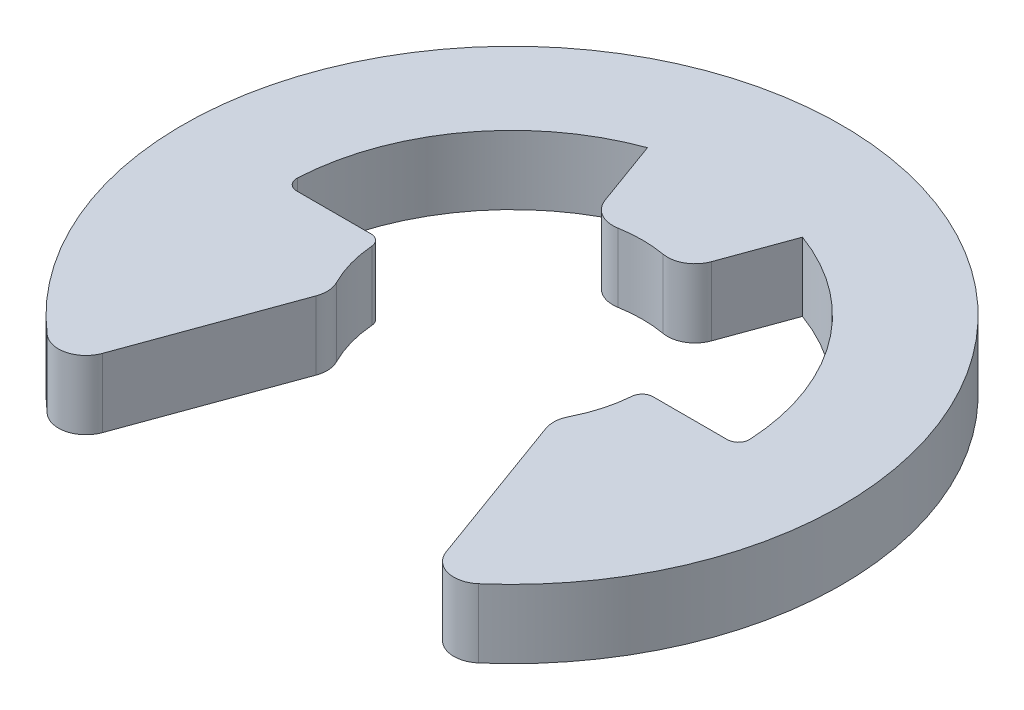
from build123d import *

# Parameters (mm, degrees)
BOSS_EXTRUDE1_DEPTH = 0.25
FILLET1_R           = 0.2
FILLET2_R           = 0.08


with BuildPart() as part:
    # Sketch2 → Boss-Extrude1 (new, symmetric)
    with BuildSketch(Plane(origin=(0, 0, 0), x_dir=(1, 0, 0), z_dir=(0, 1, 0))):
        with BuildLine():
            Line((-1.344886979, -1.987782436), (-0.805, -0.504455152))
            ThreePointArc((-0.805, -0.504455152), (-0.913030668, -0.262440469), (-0.95, 0))
            Line((-0.95, 0), (-1.65, 0))
            ThreePointArc((-1.65, 0), (-1.351600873, 0.94640112), (-0.564333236, 1.550492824))
            Line((-0.564333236, 1.550492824), (-0.324919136, 0.89270799))
            ThreePointArc((-0.324919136, 0.89270799), (0, 0.95), (0.324919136, 0.89270799))
            Line((0.324919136, 0.89270799), (0.564333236, 1.550492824))
            ThreePointArc((0.564333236, 1.550492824), (1.351600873, 0.94640112), (1.65, 0))
            Line((1.65, 0), (0.95, 0))
            ThreePointArc((0.95, 0), (0.913030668, -0.262440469), (0.805, -0.504455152))
            Line((0.805, -0.504455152), (1.344886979, -1.987782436))
            ThreePointArc((1.344886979, -1.987782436), (0, 2.4), (-1.344886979, -1.987782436))
        make_face()
    extrude(amount=BOSS_EXTRUDE1_DEPTH, both=True)

    # Fillet1
    fillet1_edges = [part.edges().sort_by_distance(p)[0] for p in [
        (-0.805, 0, 0.504455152),
        (-1.344886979, 0, 1.987782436),
        (1.344886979, 0, 1.987782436),
        (0.805, 0, 0.504455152),
        (0.324919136, 0, -0.89270799),
        (-0.324919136, 0, -0.89270799),
    ]]
    fillet(fillet1_edges, radius=FILLET1_R)

    # Fillet2
    fillet2_edges = [part.edges().sort_by_distance(p)[0] for p in [
        (-1.65, 0, 0),
        (-0.95, 0, 0),
        (0.95, 0, 0),
        (1.65, 0, 0),
    ]]
    fillet(fillet2_edges, radius=FILLET2_R)


solid = part.part
